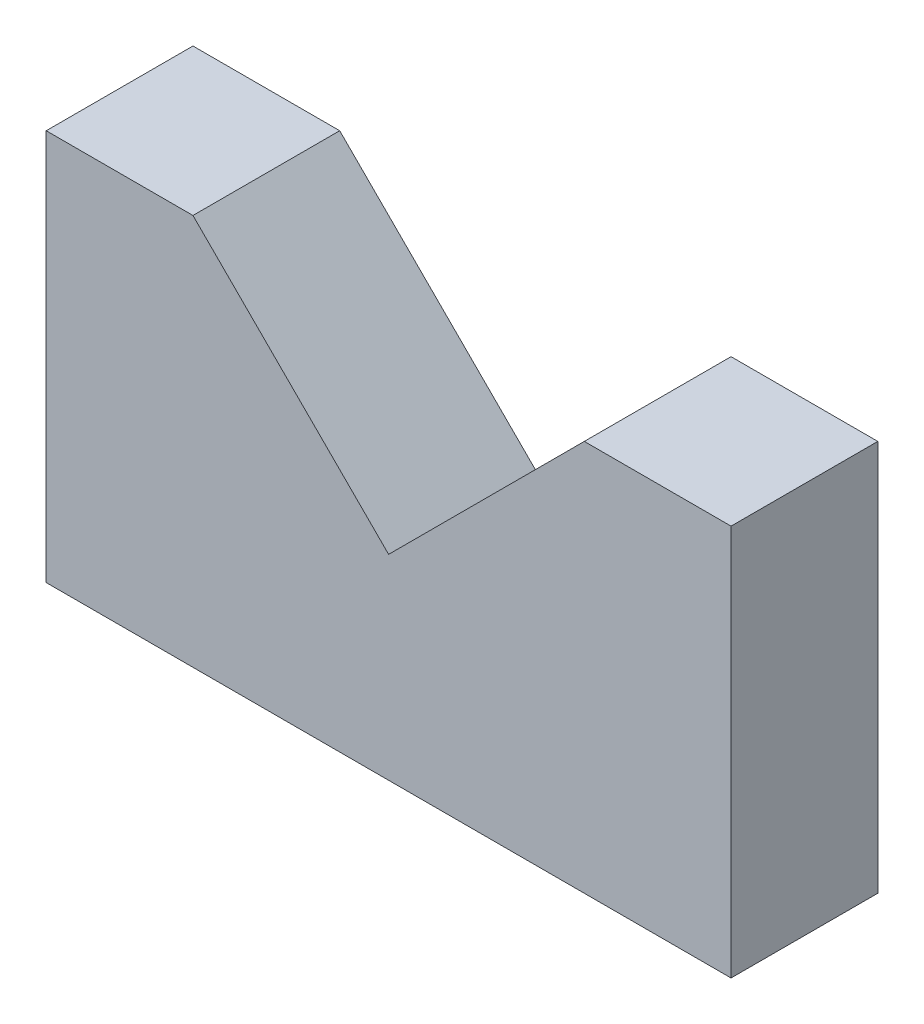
ISO-10303-21;
HEADER;
FILE_DESCRIPTION(('STEP AP214'),'2;1');
FILE_NAME('part.step','',(''),(''),'','','');
FILE_SCHEMA(('AUTOMOTIVE_DESIGN { 1 0 10303 214 1 1 1 1 }'));
ENDSEC;
DATA;
#1=APPLICATION_CONTEXT('core data for automotive mechanical design processes');
#2=APPLICATION_PROTOCOL_DEFINITION('international standard','automotive_design',2000,#1);
#3=PRODUCT_CONTEXT('',#1,'mechanical');
#4=PRODUCT('Part','Part','',(#3));
#5=PRODUCT_RELATED_PRODUCT_CATEGORY('part','',(#4));
#6=PRODUCT_DEFINITION_FORMATION('','',#4);
#7=PRODUCT_DEFINITION_CONTEXT('part definition',#1,'design');
#8=PRODUCT_DEFINITION('design','',#6,#7);
#9=PRODUCT_DEFINITION_SHAPE('','',#8);
#10=(LENGTH_UNIT() NAMED_UNIT(*) SI_UNIT(.MILLI.,.METRE.));
#11=(NAMED_UNIT(*) PLANE_ANGLE_UNIT() SI_UNIT($,.RADIAN.));
#12=(NAMED_UNIT(*) SI_UNIT($,.STERADIAN.) SOLID_ANGLE_UNIT());
#13=UNCERTAINTY_MEASURE_WITH_UNIT(LENGTH_MEASURE(1.E-05),#10,'distance_accuracy_value','');
#14=(GEOMETRIC_REPRESENTATION_CONTEXT(3) GLOBAL_UNCERTAINTY_ASSIGNED_CONTEXT((#13)) GLOBAL_UNIT_ASSIGNED_CONTEXT((#10,
#11,#12)) REPRESENTATION_CONTEXT('',''));
#15=CARTESIAN_POINT('',(0.,0.,0.));
#16=DIRECTION('',(0.,0.,1.));
#17=DIRECTION('',(1.,0.,0.));
#18=AXIS2_PLACEMENT_3D('',#15,#16,#17);
#19=CARTESIAN_POINT('',(70.,0.,15.));
#20=DIRECTION('',(0.,1.,0.));
#21=DIRECTION('',(-1.,0.,0.));
#22=AXIS2_PLACEMENT_3D('',#19,#20,#21);
#23=PLANE('',#22);
#24=DIRECTION('',(1.,0.,0.));
#25=VECTOR('',#24,1.);
#26=CARTESIAN_POINT('',(70.,0.,0.));
#27=LINE('',#26,#25);
#28=CARTESIAN_POINT('',(0.,0.,0.));
#29=VERTEX_POINT('',#28);
#30=CARTESIAN_POINT('',(70.,0.,0.));
#31=VERTEX_POINT('',#30);
#32=EDGE_CURVE('E121',#29,#31,#27,.T.);
#33=ORIENTED_EDGE('',*,*,#32,.T.);
#34=DIRECTION('',(0.,0.,-1.));
#35=VECTOR('',#34,1.);
#36=CARTESIAN_POINT('',(70.,0.,15.));
#37=LINE('',#36,#35);
#38=CARTESIAN_POINT('',(70.,0.,15.));
#39=VERTEX_POINT('',#38);
#40=EDGE_CURVE('E11',#39,#31,#37,.T.);
#41=ORIENTED_EDGE('',*,*,#40,.F.);
#42=DIRECTION('',(1.,0.,0.));
#43=VECTOR('',#42,1.);
#44=CARTESIAN_POINT('',(70.,0.,15.));
#45=LINE('',#44,#43);
#46=CARTESIAN_POINT('',(0.,0.,15.));
#47=VERTEX_POINT('',#46);
#48=EDGE_CURVE('E133',#47,#39,#45,.T.);
#49=ORIENTED_EDGE('',*,*,#48,.F.);
#50=DIRECTION('',(0.,0.,-1.));
#51=VECTOR('',#50,1.);
#52=CARTESIAN_POINT('',(0.,0.,15.));
#53=LINE('',#52,#51);
#54=EDGE_CURVE('E117',#47,#29,#53,.T.);
#55=ORIENTED_EDGE('',*,*,#54,.T.);
#56=EDGE_LOOP('',(#33,#41,#49,#55));
#57=FACE_BOUND('',#56,.T.);
#58=ADVANCED_FACE('F31',(#57),#23,.F.);
#59=CARTESIAN_POINT('',(70.,40.,15.));
#60=DIRECTION('',(-1.,0.,0.));
#61=DIRECTION('',(0.,0.,1.));
#62=AXIS2_PLACEMENT_3D('',#59,#60,#61);
#63=PLANE('',#62);
#64=DIRECTION('',(0.,1.,0.));
#65=VECTOR('',#64,1.);
#66=CARTESIAN_POINT('',(70.,40.,0.));
#67=LINE('',#66,#65);
#68=CARTESIAN_POINT('',(70.,40.,0.));
#69=VERTEX_POINT('',#68);
#70=EDGE_CURVE('E124',#31,#69,#67,.T.);
#71=ORIENTED_EDGE('',*,*,#70,.T.);
#72=DIRECTION('',(0.,0.,-1.));
#73=VECTOR('',#72,1.);
#74=CARTESIAN_POINT('',(70.,40.,15.));
#75=LINE('',#74,#73);
#76=CARTESIAN_POINT('',(70.,40.,15.));
#77=VERTEX_POINT('',#76);
#78=EDGE_CURVE('E39',#77,#69,#75,.T.);
#79=ORIENTED_EDGE('',*,*,#78,.F.);
#80=DIRECTION('',(0.,1.,0.));
#81=VECTOR('',#80,1.);
#82=CARTESIAN_POINT('',(70.,40.,15.));
#83=LINE('',#82,#81);
#84=EDGE_CURVE('E87',#39,#77,#83,.T.);
#85=ORIENTED_EDGE('',*,*,#84,.F.);
#86=ORIENTED_EDGE('',*,*,#40,.T.);
#87=EDGE_LOOP('',(#71,#79,#85,#86));
#88=FACE_BOUND('',#87,.T.);
#89=ADVANCED_FACE('F158',(#88),#63,.F.);
#90=CARTESIAN_POINT('',(55.,40.,15.));
#91=DIRECTION('',(0.,-1.,0.));
#92=DIRECTION('',(0.,0.,-1.));
#93=AXIS2_PLACEMENT_3D('',#90,#91,#92);
#94=PLANE('',#93);
#95=DIRECTION('',(-1.,0.,0.));
#96=VECTOR('',#95,1.);
#97=CARTESIAN_POINT('',(55.,40.,0.));
#98=LINE('',#97,#96);
#99=CARTESIAN_POINT('',(55.,40.,0.));
#100=VERTEX_POINT('',#99);
#101=EDGE_CURVE('E126',#69,#100,#98,.T.);
#102=ORIENTED_EDGE('',*,*,#101,.T.);
#103=DIRECTION('',(0.,0.,-1.));
#104=VECTOR('',#103,1.);
#105=CARTESIAN_POINT('',(55.,40.,15.));
#106=LINE('',#105,#104);
#107=CARTESIAN_POINT('',(55.,40.,15.));
#108=VERTEX_POINT('',#107);
#109=EDGE_CURVE('E137',#108,#100,#106,.T.);
#110=ORIENTED_EDGE('',*,*,#109,.F.);
#111=DIRECTION('',(-1.,0.,0.));
#112=VECTOR('',#111,1.);
#113=CARTESIAN_POINT('',(55.,40.,15.));
#114=LINE('',#113,#112);
#115=EDGE_CURVE('E145',#77,#108,#114,.T.);
#116=ORIENTED_EDGE('',*,*,#115,.F.);
#117=ORIENTED_EDGE('',*,*,#78,.T.);
#118=EDGE_LOOP('',(#102,#110,#116,#117));
#119=FACE_BOUND('',#118,.T.);
#120=ADVANCED_FACE('F143',(#119),#94,.F.);
#121=CARTESIAN_POINT('',(34.9999976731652,20.,15.));
#122=DIRECTION('',(0.707106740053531,-0.707106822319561,0.));
#123=DIRECTION('',(0.707106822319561,0.707106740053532,0.));
#124=AXIS2_PLACEMENT_3D('',#121,#122,#123);
#125=PLANE('',#124);
#126=DIRECTION('',(-0.707106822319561,-0.707106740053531,0.));
#127=VECTOR('',#126,1.);
#128=CARTESIAN_POINT('',(34.9999976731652,20.,0.));
#129=LINE('',#128,#127);
#130=CARTESIAN_POINT('',(34.9999976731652,20.,0.));
#131=VERTEX_POINT('',#130);
#132=EDGE_CURVE('E128',#100,#131,#129,.T.);
#133=ORIENTED_EDGE('',*,*,#132,.T.);
#134=DIRECTION('',(0.,0.,-1.));
#135=VECTOR('',#134,1.);
#136=CARTESIAN_POINT('',(34.9999976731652,20.,15.));
#137=LINE('',#136,#135);
#138=CARTESIAN_POINT('',(34.9999976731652,20.,15.));
#139=VERTEX_POINT('',#138);
#140=EDGE_CURVE('E112',#139,#131,#137,.T.);
#141=ORIENTED_EDGE('',*,*,#140,.F.);
#142=DIRECTION('',(-0.707106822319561,-0.707106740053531,0.));
#143=VECTOR('',#142,1.);
#144=CARTESIAN_POINT('',(34.9999976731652,20.,15.));
#145=LINE('',#144,#143);
#146=EDGE_CURVE('E103',#108,#139,#145,.T.);
#147=ORIENTED_EDGE('',*,*,#146,.F.);
#148=ORIENTED_EDGE('',*,*,#109,.T.);
#149=EDGE_LOOP('',(#133,#141,#147,#148));
#150=FACE_BOUND('',#149,.T.);
#151=ADVANCED_FACE('F151',(#150),#125,.F.);
#152=CARTESIAN_POINT('',(15.,40.,15.));
#153=DIRECTION('',(-0.707106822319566,-0.707106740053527,0.));
#154=DIRECTION('',(0.707106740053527,-0.707106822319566,0.));
#155=AXIS2_PLACEMENT_3D('',#152,#153,#154);
#156=PLANE('',#155);
#157=DIRECTION('',(-0.707106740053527,0.707106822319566,0.));
#158=VECTOR('',#157,1.);
#159=CARTESIAN_POINT('',(15.,40.,0.));
#160=LINE('',#159,#158);
#161=CARTESIAN_POINT('',(15.,40.,0.));
#162=VERTEX_POINT('',#161);
#163=EDGE_CURVE('E111',#131,#162,#160,.T.);
#164=ORIENTED_EDGE('',*,*,#163,.T.);
#165=DIRECTION('',(0.,0.,-1.));
#166=VECTOR('',#165,1.);
#167=CARTESIAN_POINT('',(15.,40.,15.));
#168=LINE('',#167,#166);
#169=CARTESIAN_POINT('',(15.,40.,15.));
#170=VERTEX_POINT('',#169);
#171=EDGE_CURVE('E108',#170,#162,#168,.T.);
#172=ORIENTED_EDGE('',*,*,#171,.F.);
#173=DIRECTION('',(-0.707106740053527,0.707106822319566,0.));
#174=VECTOR('',#173,1.);
#175=CARTESIAN_POINT('',(15.,40.,15.));
#176=LINE('',#175,#174);
#177=EDGE_CURVE('E97',#139,#170,#176,.T.);
#178=ORIENTED_EDGE('',*,*,#177,.F.);
#179=ORIENTED_EDGE('',*,*,#140,.T.);
#180=EDGE_LOOP('',(#164,#172,#178,#179));
#181=FACE_BOUND('',#180,.T.);
#182=ADVANCED_FACE('F109',(#181),#156,.F.);
#183=CARTESIAN_POINT('',(0.,40.,15.));
#184=DIRECTION('',(0.,-1.,0.));
#185=DIRECTION('',(0.,0.,-1.));
#186=AXIS2_PLACEMENT_3D('',#183,#184,#185);
#187=PLANE('',#186);
#188=DIRECTION('',(-1.,0.,0.));
#189=VECTOR('',#188,1.);
#190=CARTESIAN_POINT('',(0.,40.,0.));
#191=LINE('',#190,#189);
#192=CARTESIAN_POINT('',(0.,40.,0.));
#193=VERTEX_POINT('',#192);
#194=EDGE_CURVE('E73',#162,#193,#191,.T.);
#195=ORIENTED_EDGE('',*,*,#194,.T.);
#196=DIRECTION('',(0.,0.,-1.));
#197=VECTOR('',#196,1.);
#198=CARTESIAN_POINT('',(0.,40.,15.));
#199=LINE('',#198,#197);
#200=CARTESIAN_POINT('',(0.,40.,15.));
#201=VERTEX_POINT('',#200);
#202=EDGE_CURVE('E113',#201,#193,#199,.T.);
#203=ORIENTED_EDGE('',*,*,#202,.F.);
#204=DIRECTION('',(-1.,0.,0.));
#205=VECTOR('',#204,1.);
#206=CARTESIAN_POINT('',(0.,40.,15.));
#207=LINE('',#206,#205);
#208=EDGE_CURVE('E101',#170,#201,#207,.T.);
#209=ORIENTED_EDGE('',*,*,#208,.F.);
#210=ORIENTED_EDGE('',*,*,#171,.T.);
#211=EDGE_LOOP('',(#195,#203,#209,#210));
#212=FACE_BOUND('',#211,.T.);
#213=ADVANCED_FACE('F115',(#212),#187,.F.);
#214=CARTESIAN_POINT('',(0.,0.,15.));
#215=DIRECTION('',(1.,0.,0.));
#216=DIRECTION('',(0.,0.,-1.));
#217=AXIS2_PLACEMENT_3D('',#214,#215,#216);
#218=PLANE('',#217);
#219=DIRECTION('',(0.,-1.,0.));
#220=VECTOR('',#219,1.);
#221=CARTESIAN_POINT('',(0.,0.,0.));
#222=LINE('',#221,#220);
#223=EDGE_CURVE('E79',#193,#29,#222,.T.);
#224=ORIENTED_EDGE('',*,*,#223,.T.);
#225=ORIENTED_EDGE('',*,*,#54,.F.);
#226=DIRECTION('',(0.,-1.,0.));
#227=VECTOR('',#226,1.);
#228=CARTESIAN_POINT('',(0.,0.,15.));
#229=LINE('',#228,#227);
#230=EDGE_CURVE('E47',#201,#47,#229,.T.);
#231=ORIENTED_EDGE('',*,*,#230,.F.);
#232=ORIENTED_EDGE('',*,*,#202,.T.);
#233=EDGE_LOOP('',(#224,#225,#231,#232));
#234=FACE_BOUND('',#233,.T.);
#235=ADVANCED_FACE('F172',(#234),#218,.F.);
#236=CARTESIAN_POINT('',(0.,0.,15.));
#237=DIRECTION('',(0.,0.,-1.));
#238=DIRECTION('',(-1.,0.,0.));
#239=AXIS2_PLACEMENT_3D('',#236,#237,#238);
#240=PLANE('',#239);
#241=ORIENTED_EDGE('',*,*,#48,.T.);
#242=ORIENTED_EDGE('',*,*,#84,.T.);
#243=ORIENTED_EDGE('',*,*,#115,.T.);
#244=ORIENTED_EDGE('',*,*,#146,.T.);
#245=ORIENTED_EDGE('',*,*,#177,.T.);
#246=ORIENTED_EDGE('',*,*,#208,.T.);
#247=ORIENTED_EDGE('',*,*,#230,.T.);
#248=EDGE_LOOP('',(#241,#242,#243,#244,#245,#246,#247));
#249=FACE_BOUND('',#248,.T.);
#250=ADVANCED_FACE('F99',(#249),#240,.F.);
#251=CARTESIAN_POINT('',(0.,0.,0.));
#252=DIRECTION('',(0.,0.,-1.));
#253=DIRECTION('',(-1.,0.,0.));
#254=AXIS2_PLACEMENT_3D('',#251,#252,#253);
#255=PLANE('',#254);
#256=ORIENTED_EDGE('',*,*,#32,.F.);
#257=ORIENTED_EDGE('',*,*,#223,.F.);
#258=ORIENTED_EDGE('',*,*,#194,.F.);
#259=ORIENTED_EDGE('',*,*,#163,.F.);
#260=ORIENTED_EDGE('',*,*,#132,.F.);
#261=ORIENTED_EDGE('',*,*,#101,.F.);
#262=ORIENTED_EDGE('',*,*,#70,.F.);
#263=EDGE_LOOP('',(#256,#257,#258,#259,#260,#261,#262));
#264=FACE_BOUND('',#263,.T.);
#265=ADVANCED_FACE('F149',(#264),#255,.T.);
#266=CLOSED_SHELL('',(#58,#89,#120,#151,#182,#213,#235,#250,#265));
#267=MANIFOLD_SOLID_BREP('B2',#266);
#268=ADVANCED_BREP_SHAPE_REPRESENTATION('',(#18,#267),#14);
#269=SHAPE_DEFINITION_REPRESENTATION(#9,#268);
ENDSEC;
END-ISO-10303-21;
